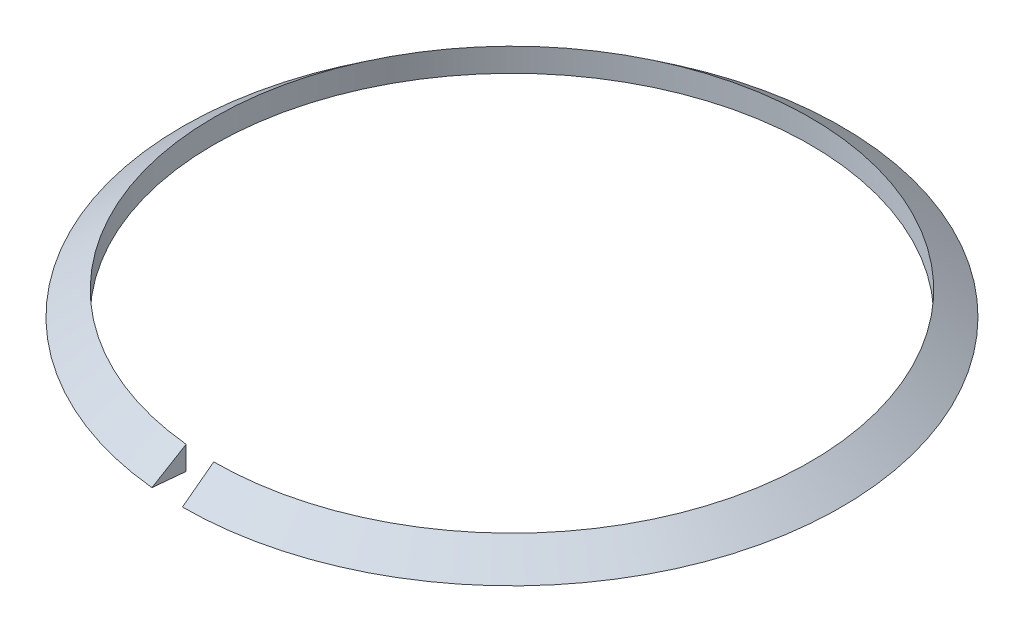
ISO-10303-21;
HEADER;
FILE_DESCRIPTION(('STEP AP214'),'2;1');
FILE_NAME('part.step','',(''),(''),'','','');
FILE_SCHEMA(('AUTOMOTIVE_DESIGN { 1 0 10303 214 1 1 1 1 }'));
ENDSEC;
DATA;
#1=APPLICATION_CONTEXT('core data for automotive mechanical design processes');
#2=APPLICATION_PROTOCOL_DEFINITION('international standard','automotive_design',2000,#1);
#3=PRODUCT_CONTEXT('',#1,'mechanical');
#4=PRODUCT('Part','Part','',(#3));
#5=PRODUCT_RELATED_PRODUCT_CATEGORY('part','',(#4));
#6=PRODUCT_DEFINITION_FORMATION('','',#4);
#7=PRODUCT_DEFINITION_CONTEXT('part definition',#1,'design');
#8=PRODUCT_DEFINITION('design','',#6,#7);
#9=PRODUCT_DEFINITION_SHAPE('','',#8);
#10=(LENGTH_UNIT() NAMED_UNIT(*) SI_UNIT(.MILLI.,.METRE.));
#11=(NAMED_UNIT(*) PLANE_ANGLE_UNIT() SI_UNIT($,.RADIAN.));
#12=(NAMED_UNIT(*) SI_UNIT($,.STERADIAN.) SOLID_ANGLE_UNIT());
#13=UNCERTAINTY_MEASURE_WITH_UNIT(LENGTH_MEASURE(1.E-05),#10,'distance_accuracy_value','');
#14=(GEOMETRIC_REPRESENTATION_CONTEXT(3) GLOBAL_UNCERTAINTY_ASSIGNED_CONTEXT((#13)) GLOBAL_UNIT_ASSIGNED_CONTEXT((#10,
#11,#12)) REPRESENTATION_CONTEXT('',''));
#15=CARTESIAN_POINT('',(0.,0.,0.));
#16=DIRECTION('',(0.,0.,1.));
#17=DIRECTION('',(1.,0.,0.));
#18=AXIS2_PLACEMENT_3D('',#15,#16,#17);
#19=CARTESIAN_POINT('',(0.,0.750569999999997,0.));
#20=DIRECTION('',(0.,-1.,0.));
#21=DIRECTION('',(0.,0.,-1.));
#22=AXIS2_PLACEMENT_3D('',#19,#20,#21);
#23=CONICAL_SURFACE('',#22,19.05,0.926685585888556);
#24=CARTESIAN_POINT('',(0.,0.750569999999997,0.));
#25=DIRECTION('',(0.,-1.,0.));
#26=DIRECTION('',(0.,0.,-1.));
#27=AXIS2_PLACEMENT_3D('',#24,#25,#26);
#28=CIRCLE('',#27,19.05);
#29=CARTESIAN_POINT('',(-1.85399070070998,0.750569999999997,18.9595679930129));
#30=VERTEX_POINT('',#29);
#31=CARTESIAN_POINT('',(0.,0.750569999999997,19.05));
#32=VERTEX_POINT('',#31);
#33=EDGE_CURVE('E11',#30,#32,#28,.T.);
#34=ORIENTED_EDGE('',*,*,#33,.T.);
#35=DIRECTION('',(0.,-0.600487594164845,0.799634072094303));
#36=VECTOR('',#35,1.);
#37=CARTESIAN_POINT('',(0.,-0.750570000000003,21.04898));
#38=LINE('',#37,#36);
#39=CARTESIAN_POINT('',(0.,-0.750570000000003,21.04898));
#40=VERTEX_POINT('',#39);
#41=EDGE_CURVE('E76',#32,#40,#38,.T.);
#42=ORIENTED_EDGE('',*,*,#41,.T.);
#43=CARTESIAN_POINT('',(0.,-0.750570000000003,0.));
#44=DIRECTION('',(0.,-1.,0.));
#45=DIRECTION('',(0.,0.,-1.));
#46=AXIS2_PLACEMENT_3D('',#43,#44,#45);
#47=CIRCLE('',#46,21.04898);
#48=CARTESIAN_POINT('',(-2.04853612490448,-0.750570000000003,20.9490586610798));
#49=VERTEX_POINT('',#48);
#50=EDGE_CURVE('E61',#49,#40,#47,.T.);
#51=ORIENTED_EDGE('',*,*,#50,.F.);
#52=DIRECTION('',(-0.0778222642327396,-0.600487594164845,0.795838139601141));
#53=VECTOR('',#52,1.);
#54=CARTESIAN_POINT('',(-2.04853612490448,-0.750570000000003,20.9490586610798));
#55=LINE('',#54,#53);
#56=EDGE_CURVE('E82',#30,#49,#55,.T.);
#57=ORIENTED_EDGE('',*,*,#56,.F.);
#58=EDGE_LOOP('',(#34,#42,#51,#57));
#59=FACE_BOUND('',#58,.T.);
#60=ADVANCED_FACE('F30',(#59),#23,.T.);
#61=CARTESIAN_POINT('',(0.,0.,0.));
#62=DIRECTION('',(0.,-1.,0.));
#63=DIRECTION('',(0.,0.,-1.));
#64=AXIS2_PLACEMENT_3D('',#61,#62,#63);
#65=CYLINDRICAL_SURFACE('',#64,19.05);
#66=CARTESIAN_POINT('',(0.,-0.750570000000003,0.));
#67=DIRECTION('',(0.,-1.,0.));
#68=DIRECTION('',(0.,0.,-1.));
#69=AXIS2_PLACEMENT_3D('',#66,#67,#68);
#70=CIRCLE('',#69,19.05);
#71=CARTESIAN_POINT('',(-1.85399070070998,-0.750570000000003,18.9595679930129));
#72=VERTEX_POINT('',#71);
#73=CARTESIAN_POINT('',(0.,-0.750570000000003,19.05));
#74=VERTEX_POINT('',#73);
#75=EDGE_CURVE('E38',#72,#74,#70,.T.);
#76=ORIENTED_EDGE('',*,*,#75,.T.);
#77=DIRECTION('',(0.,1.,0.));
#78=VECTOR('',#77,1.);
#79=CARTESIAN_POINT('',(0.,0.750569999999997,19.05));
#80=LINE('',#79,#78);
#81=EDGE_CURVE('E77',#74,#32,#80,.T.);
#82=ORIENTED_EDGE('',*,*,#81,.T.);
#83=ORIENTED_EDGE('',*,*,#33,.F.);
#84=DIRECTION('',(0.,1.,0.));
#85=VECTOR('',#84,1.);
#86=CARTESIAN_POINT('',(-1.85399070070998,0.750569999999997,18.9595679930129));
#87=LINE('',#86,#85);
#88=EDGE_CURVE('E71',#72,#30,#87,.T.);
#89=ORIENTED_EDGE('',*,*,#88,.F.);
#90=EDGE_LOOP('',(#76,#82,#83,#89));
#91=FACE_BOUND('',#90,.T.);
#92=ADVANCED_FACE('F32',(#91),#65,.F.);
#93=CARTESIAN_POINT('',(-1.85399070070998,-0.750570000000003,18.9595679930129));
#94=DIRECTION('',(0.,1.,0.));
#95=DIRECTION('',(0.,0.,1.));
#96=AXIS2_PLACEMENT_3D('',#93,#94,#95);
#97=PLANE('',#96);
#98=DIRECTION('',(0.0973223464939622,0.,-0.995252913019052));
#99=VECTOR('',#98,1.);
#100=CARTESIAN_POINT('',(-1.85399070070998,-0.750570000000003,18.9595679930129));
#101=LINE('',#100,#99);
#102=EDGE_CURVE('E66',#49,#72,#101,.T.);
#103=ORIENTED_EDGE('',*,*,#102,.F.);
#104=ORIENTED_EDGE('',*,*,#50,.T.);
#105=DIRECTION('',(0.,0.,-1.));
#106=VECTOR('',#105,1.);
#107=CARTESIAN_POINT('',(0.,-0.750570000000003,19.05));
#108=LINE('',#107,#106);
#109=EDGE_CURVE('E64',#40,#74,#108,.T.);
#110=ORIENTED_EDGE('',*,*,#109,.T.);
#111=ORIENTED_EDGE('',*,*,#75,.F.);
#112=EDGE_LOOP('',(#103,#104,#110,#111));
#113=FACE_BOUND('',#112,.T.);
#114=ADVANCED_FACE('F63',(#113),#97,.F.);
#115=CARTESIAN_POINT('',(-1.85399070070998,0.750569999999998,18.9595679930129));
#116=DIRECTION('',(-0.995252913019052,0.,-0.0973223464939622));
#117=DIRECTION('',(-0.0973223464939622,0.,0.995252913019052));
#118=AXIS2_PLACEMENT_3D('',#115,#116,#117);
#119=PLANE('',#118);
#120=ORIENTED_EDGE('',*,*,#56,.T.);
#121=ORIENTED_EDGE('',*,*,#102,.T.);
#122=ORIENTED_EDGE('',*,*,#88,.T.);
#123=EDGE_LOOP('',(#120,#121,#122));
#124=FACE_BOUND('',#123,.T.);
#125=ADVANCED_FACE('F86',(#124),#119,.F.);
#126=CARTESIAN_POINT('',(0.,0.750569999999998,19.05));
#127=DIRECTION('',(-1.,0.,0.));
#128=DIRECTION('',(0.,0.,1.));
#129=AXIS2_PLACEMENT_3D('',#126,#127,#128);
#130=PLANE('',#129);
#131=ORIENTED_EDGE('',*,*,#41,.F.);
#132=ORIENTED_EDGE('',*,*,#81,.F.);
#133=ORIENTED_EDGE('',*,*,#109,.F.);
#134=EDGE_LOOP('',(#131,#132,#133));
#135=FACE_BOUND('',#134,.T.);
#136=ADVANCED_FACE('F75',(#135),#130,.T.);
#137=CLOSED_SHELL('',(#60,#92,#114,#125,#136));
#138=MANIFOLD_SOLID_BREP('B2',#137);
#139=ADVANCED_BREP_SHAPE_REPRESENTATION('',(#18,#138),#14);
#140=SHAPE_DEFINITION_REPRESENTATION(#9,#139);
ENDSEC;
END-ISO-10303-21;
